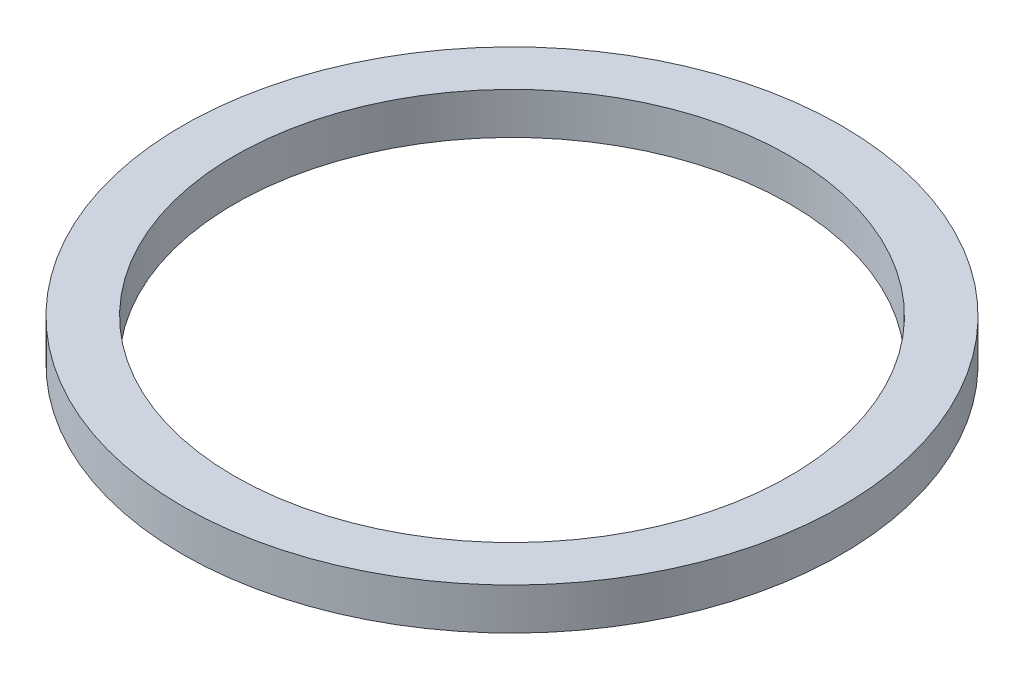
from build123d import *

# Parameters (mm, degrees)
ESQUISSE1_R      = 47.5
ESQUISSE1_R_2    = 40
EXTRUSION1_DEPTH = 6


with BuildPart() as part:
    # Esquisse1 → Extrusion1 (new body)
    with BuildSketch(Plane(origin=(0, 0, 0), x_dir=(1, 0, 0), z_dir=(0, 1, 0))):
        with Locations(Location((0, 0, 0), (0, 0, 270))):
            Circle(ESQUISSE1_R)
        with Locations(Location((0, 0, 0), (0, 0, 270))):
            Circle(ESQUISSE1_R_2, mode=Mode.SUBTRACT)
    extrude(amount=EXTRUSION1_DEPTH)


solid = part.part
